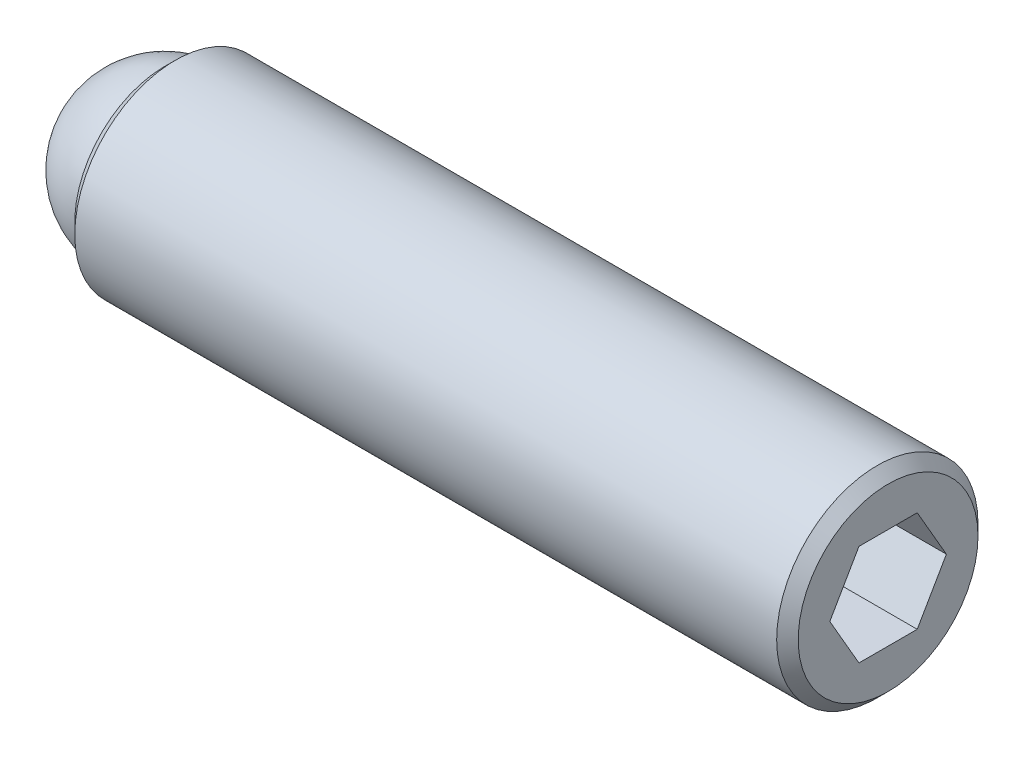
ISO-10303-21;
HEADER;
FILE_DESCRIPTION(('STEP AP214'),'2;1');
FILE_NAME('part.step','',(''),(''),'','','');
FILE_SCHEMA(('AUTOMOTIVE_DESIGN { 1 0 10303 214 1 1 1 1 }'));
ENDSEC;
DATA;
#1=APPLICATION_CONTEXT('core data for automotive mechanical design processes');
#2=APPLICATION_PROTOCOL_DEFINITION('international standard','automotive_design',2000,#1);
#3=PRODUCT_CONTEXT('',#1,'mechanical');
#4=PRODUCT('Part','Part','',(#3));
#5=PRODUCT_RELATED_PRODUCT_CATEGORY('part','',(#4));
#6=PRODUCT_DEFINITION_FORMATION('','',#4);
#7=PRODUCT_DEFINITION_CONTEXT('part definition',#1,'design');
#8=PRODUCT_DEFINITION('design','',#6,#7);
#9=PRODUCT_DEFINITION_SHAPE('','',#8);
#10=(LENGTH_UNIT() NAMED_UNIT(*) SI_UNIT(.MILLI.,.METRE.));
#11=(NAMED_UNIT(*) PLANE_ANGLE_UNIT() SI_UNIT($,.RADIAN.));
#12=(NAMED_UNIT(*) SI_UNIT($,.STERADIAN.) SOLID_ANGLE_UNIT());
#13=UNCERTAINTY_MEASURE_WITH_UNIT(LENGTH_MEASURE(1.E-05),#10,'distance_accuracy_value','');
#14=(GEOMETRIC_REPRESENTATION_CONTEXT(3) GLOBAL_UNCERTAINTY_ASSIGNED_CONTEXT((#13)) GLOBAL_UNIT_ASSIGNED_CONTEXT((#10,
#11,#12)) REPRESENTATION_CONTEXT('',''));
#15=CARTESIAN_POINT('',(0.,0.,0.));
#16=DIRECTION('',(0.,0.,1.));
#17=DIRECTION('',(1.,0.,0.));
#18=AXIS2_PLACEMENT_3D('',#15,#16,#17);
#19=CARTESIAN_POINT('',(0.,0.,0.));
#20=DIRECTION('',(0.,-1.,0.));
#21=DIRECTION('',(0.,0.,1.));
#22=AXIS2_PLACEMENT_3D('',#19,#20,#21);
#23=SPHERICAL_SURFACE('',#22,1.984375);
#24=CARTESIAN_POINT('',(0.,-1.984375,0.));
#25=VERTEX_POINT('',#24);
#26=VERTEX_LOOP('',#25);
#27=FACE_BOUND('',#26,.T.);
#28=ADVANCED_FACE('F42',(#27),#23,.T.);
#29=CLOSED_SHELL('',(#28));
#30=MANIFOLD_SOLID_BREP('B2',#29);
#31=CARTESIAN_POINT('',(17.065625,0.,0.));
#32=DIRECTION('',(-1.,0.,0.));
#33=DIRECTION('',(0.,0.,1.));
#34=AXIS2_PLACEMENT_3D('',#31,#32,#33);
#35=CYLINDRICAL_SURFACE('',#34,2.3749);
#36=CARTESIAN_POINT('',(16.811625,0.,0.));
#37=DIRECTION('',(1.,0.,0.));
#38=DIRECTION('',(0.,0.,-1.));
#39=AXIS2_PLACEMENT_3D('',#36,#37,#38);
#40=CIRCLE('',#39,2.3749);
#41=CARTESIAN_POINT('',(16.811625,0.,-2.3749));
#42=VERTEX_POINT('',#41);
#43=EDGE_CURVE('E40',#42,#42,#40,.F.);
#44=ORIENTED_EDGE('',*,*,#43,.T.);
#45=EDGE_LOOP('',(#44));
#46=FACE_BOUND('',#45,.T.);
#47=CARTESIAN_POINT('',(0.254000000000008,0.,0.));
#48=DIRECTION('',(1.,0.,0.));
#49=DIRECTION('',(0.,0.,-1.));
#50=AXIS2_PLACEMENT_3D('',#47,#48,#49);
#51=CIRCLE('',#50,2.3749);
#52=CARTESIAN_POINT('',(0.254000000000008,0.,-2.3749));
#53=VERTEX_POINT('',#52);
#54=EDGE_CURVE('E158',#53,#53,#51,.T.);
#55=ORIENTED_EDGE('',*,*,#54,.T.);
#56=EDGE_LOOP('',(#55));
#57=FACE_BOUND('',#56,.T.);
#58=ADVANCED_FACE('F55',(#46,#57),#35,.T.);
#59=CARTESIAN_POINT('',(17.065625,0.,0.));
#60=DIRECTION('',(1.,0.,0.));
#61=DIRECTION('',(0.,0.,-1.));
#62=AXIS2_PLACEMENT_3D('',#59,#60,#61);
#63=PLANE('',#62);
#64=DIRECTION('',(0.,0.866025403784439,-0.5));
#65=VECTOR('',#64,1.);
#66=CARTESIAN_POINT('',(17.065625,-1.190625,-0.687407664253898));
#67=LINE('',#66,#65);
#68=CARTESIAN_POINT('',(17.065625,-1.190625,-0.687407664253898));
#69=VERTEX_POINT('',#68);
#70=CARTESIAN_POINT('',(17.065625,0.,-1.3748153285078));
#71=VERTEX_POINT('',#70);
#72=EDGE_CURVE('E70',#69,#71,#67,.T.);
#73=ORIENTED_EDGE('',*,*,#72,.F.);
#74=DIRECTION('',(0.,0.,-1.));
#75=VECTOR('',#74,1.);
#76=CARTESIAN_POINT('',(17.065625,-1.190625,0.687407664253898));
#77=LINE('',#76,#75);
#78=CARTESIAN_POINT('',(17.065625,-1.190625,0.687407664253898));
#79=VERTEX_POINT('',#78);
#80=EDGE_CURVE('E154',#79,#69,#77,.T.);
#81=ORIENTED_EDGE('',*,*,#80,.F.);
#82=DIRECTION('',(0.,-0.866025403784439,-0.5));
#83=VECTOR('',#82,1.);
#84=CARTESIAN_POINT('',(17.065625,0.,1.3748153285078));
#85=LINE('',#84,#83);
#86=CARTESIAN_POINT('',(17.065625,0.,1.3748153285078));
#87=VERTEX_POINT('',#86);
#88=EDGE_CURVE('E152',#87,#79,#85,.T.);
#89=ORIENTED_EDGE('',*,*,#88,.F.);
#90=DIRECTION('',(0.,-0.866025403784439,0.5));
#91=VECTOR('',#90,1.);
#92=CARTESIAN_POINT('',(17.065625,1.190625,0.687407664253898));
#93=LINE('',#92,#91);
#94=CARTESIAN_POINT('',(17.065625,1.190625,0.687407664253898));
#95=VERTEX_POINT('',#94);
#96=EDGE_CURVE('E118',#95,#87,#93,.T.);
#97=ORIENTED_EDGE('',*,*,#96,.F.);
#98=DIRECTION('',(0.,0.,1.));
#99=VECTOR('',#98,1.);
#100=CARTESIAN_POINT('',(17.065625,1.190625,-0.687407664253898));
#101=LINE('',#100,#99);
#102=CARTESIAN_POINT('',(17.065625,1.190625,-0.687407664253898));
#103=VERTEX_POINT('',#102);
#104=EDGE_CURVE('E148',#103,#95,#101,.T.);
#105=ORIENTED_EDGE('',*,*,#104,.F.);
#106=DIRECTION('',(0.,0.866025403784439,0.5));
#107=VECTOR('',#106,1.);
#108=CARTESIAN_POINT('',(17.065625,0.,-1.3748153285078));
#109=LINE('',#108,#107);
#110=EDGE_CURVE('E144',#71,#103,#109,.T.);
#111=ORIENTED_EDGE('',*,*,#110,.F.);
#112=EDGE_LOOP('',(#73,#81,#89,#97,#105,#111));
#113=FACE_BOUND('',#112,.T.);
#114=CARTESIAN_POINT('',(17.065625,0.,0.));
#115=DIRECTION('',(1.,0.,0.));
#116=DIRECTION('',(0.,0.,-1.));
#117=AXIS2_PLACEMENT_3D('',#114,#115,#116);
#118=CIRCLE('',#117,2.1209);
#119=CARTESIAN_POINT('',(17.065625,0.,-2.1209));
#120=VERTEX_POINT('',#119);
#121=EDGE_CURVE('E63',#120,#120,#118,.T.);
#122=ORIENTED_EDGE('',*,*,#121,.T.);
#123=EDGE_LOOP('',(#122));
#124=FACE_BOUND('',#123,.T.);
#125=ADVANCED_FACE('F171',(#113,#124),#63,.T.);
#126=CARTESIAN_POINT('',(0.,0.,0.));
#127=DIRECTION('',(1.,0.,0.));
#128=DIRECTION('',(0.,0.,-1.));
#129=AXIS2_PLACEMENT_3D('',#126,#127,#128);
#130=PLANE('',#129);
#131=CARTESIAN_POINT('',(0.,0.,0.));
#132=DIRECTION('',(-1.,0.,0.));
#133=DIRECTION('',(0.,0.,1.));
#134=AXIS2_PLACEMENT_3D('',#131,#132,#133);
#135=CIRCLE('',#134,1.9812);
#136=CARTESIAN_POINT('',(0.,0.,1.9812));
#137=VERTEX_POINT('',#136);
#138=EDGE_CURVE('E223',#137,#137,#135,.T.);
#139=ORIENTED_EDGE('',*,*,#138,.F.);
#140=EDGE_LOOP('',(#139));
#141=FACE_BOUND('',#140,.T.);
#142=CARTESIAN_POINT('',(0.,0.,0.));
#143=DIRECTION('',(1.,0.,0.));
#144=DIRECTION('',(0.,0.,-1.));
#145=AXIS2_PLACEMENT_3D('',#142,#143,#144);
#146=CIRCLE('',#145,2.12089999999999);
#147=CARTESIAN_POINT('',(0.,0.,-2.12089999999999));
#148=VERTEX_POINT('',#147);
#149=EDGE_CURVE('E166',#148,#148,#146,.F.);
#150=ORIENTED_EDGE('',*,*,#149,.T.);
#151=EDGE_LOOP('',(#150));
#152=FACE_BOUND('',#151,.T.);
#153=ADVANCED_FACE('F182',(#141,#152),#130,.F.);
#154=CARTESIAN_POINT('',(0.254000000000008,0.,0.));
#155=DIRECTION('',(1.,0.,0.));
#156=DIRECTION('',(0.,0.,-1.));
#157=AXIS2_PLACEMENT_3D('',#154,#155,#156);
#158=CONICAL_SURFACE('',#157,2.3749,0.785398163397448);
#159=ORIENTED_EDGE('',*,*,#149,.F.);
#160=EDGE_LOOP('',(#159));
#161=FACE_BOUND('',#160,.T.);
#162=ORIENTED_EDGE('',*,*,#54,.F.);
#163=EDGE_LOOP('',(#162));
#164=FACE_BOUND('',#163,.T.);
#165=ADVANCED_FACE('F175',(#161,#164),#158,.T.);
#166=CARTESIAN_POINT('',(17.065625,0.,0.));
#167=DIRECTION('',(-1.,0.,0.));
#168=DIRECTION('',(0.,0.,1.));
#169=AXIS2_PLACEMENT_3D('',#166,#167,#168);
#170=CONICAL_SURFACE('',#169,2.1209,0.785398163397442);
#171=ORIENTED_EDGE('',*,*,#43,.F.);
#172=EDGE_LOOP('',(#171));
#173=FACE_BOUND('',#172,.T.);
#174=ORIENTED_EDGE('',*,*,#121,.F.);
#175=EDGE_LOOP('',(#174));
#176=FACE_BOUND('',#175,.T.);
#177=ADVANCED_FACE('F57',(#173,#176),#170,.T.);
#178=CARTESIAN_POINT('',(14.779625,-1.190625,-0.687407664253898));
#179=DIRECTION('',(0.,-0.5,-0.866025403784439));
#180=DIRECTION('',(0.,0.866025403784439,-0.5));
#181=AXIS2_PLACEMENT_3D('',#178,#179,#180);
#182=PLANE('',#181);
#183=ORIENTED_EDGE('',*,*,#72,.T.);
#184=DIRECTION('',(1.,0.,0.));
#185=VECTOR('',#184,1.);
#186=CARTESIAN_POINT('',(14.779625,0.,-1.3748153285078));
#187=LINE('',#186,#185);
#188=CARTESIAN_POINT('',(14.779625,0.,-1.3748153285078));
#189=VERTEX_POINT('',#188);
#190=EDGE_CURVE('E100',#189,#71,#187,.T.);
#191=ORIENTED_EDGE('',*,*,#190,.F.);
#192=DIRECTION('',(0.,0.866025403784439,-0.5));
#193=VECTOR('',#192,1.);
#194=CARTESIAN_POINT('',(14.779625,-1.190625,-0.687407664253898));
#195=LINE('',#194,#193);
#196=CARTESIAN_POINT('',(14.779625,-1.190625,-0.687407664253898));
#197=VERTEX_POINT('',#196);
#198=EDGE_CURVE('E156',#197,#189,#195,.T.);
#199=ORIENTED_EDGE('',*,*,#198,.F.);
#200=DIRECTION('',(1.,0.,0.));
#201=VECTOR('',#200,1.);
#202=CARTESIAN_POINT('',(14.779625,-1.190625,-0.687407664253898));
#203=LINE('',#202,#201);
#204=EDGE_CURVE('E78',#197,#69,#203,.T.);
#205=ORIENTED_EDGE('',*,*,#204,.T.);
#206=EDGE_LOOP('',(#183,#191,#199,#205));
#207=FACE_BOUND('',#206,.T.);
#208=ADVANCED_FACE('F174',(#207),#182,.F.);
#209=CARTESIAN_POINT('',(14.779625,-1.190625,0.687407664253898));
#210=DIRECTION('',(0.,-1.,0.));
#211=DIRECTION('',(0.,0.,-1.));
#212=AXIS2_PLACEMENT_3D('',#209,#210,#211);
#213=PLANE('',#212);
#214=ORIENTED_EDGE('',*,*,#80,.T.);
#215=ORIENTED_EDGE('',*,*,#204,.F.);
#216=DIRECTION('',(0.,0.,-1.));
#217=VECTOR('',#216,1.);
#218=CARTESIAN_POINT('',(14.779625,-1.190625,0.687407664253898));
#219=LINE('',#218,#217);
#220=CARTESIAN_POINT('',(14.779625,-1.190625,0.687407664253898));
#221=VERTEX_POINT('',#220);
#222=EDGE_CURVE('E130',#221,#197,#219,.T.);
#223=ORIENTED_EDGE('',*,*,#222,.F.);
#224=DIRECTION('',(1.,0.,0.));
#225=VECTOR('',#224,1.);
#226=CARTESIAN_POINT('',(14.779625,-1.190625,0.687407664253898));
#227=LINE('',#226,#225);
#228=EDGE_CURVE('E122',#221,#79,#227,.T.);
#229=ORIENTED_EDGE('',*,*,#228,.T.);
#230=EDGE_LOOP('',(#214,#215,#223,#229));
#231=FACE_BOUND('',#230,.T.);
#232=ADVANCED_FACE('F180',(#231),#213,.F.);
#233=CARTESIAN_POINT('',(14.779625,0.,1.3748153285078));
#234=DIRECTION('',(0.,-0.5,0.866025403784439));
#235=DIRECTION('',(0.,-0.866025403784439,-0.5));
#236=AXIS2_PLACEMENT_3D('',#233,#234,#235);
#237=PLANE('',#236);
#238=ORIENTED_EDGE('',*,*,#88,.T.);
#239=ORIENTED_EDGE('',*,*,#228,.F.);
#240=DIRECTION('',(0.,-0.866025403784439,-0.5));
#241=VECTOR('',#240,1.);
#242=CARTESIAN_POINT('',(14.779625,0.,1.3748153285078));
#243=LINE('',#242,#241);
#244=CARTESIAN_POINT('',(14.779625,0.,1.3748153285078));
#245=VERTEX_POINT('',#244);
#246=EDGE_CURVE('E126',#245,#221,#243,.T.);
#247=ORIENTED_EDGE('',*,*,#246,.F.);
#248=DIRECTION('',(1.,0.,0.));
#249=VECTOR('',#248,1.);
#250=CARTESIAN_POINT('',(14.779625,0.,1.3748153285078));
#251=LINE('',#250,#249);
#252=EDGE_CURVE('E111',#245,#87,#251,.T.);
#253=ORIENTED_EDGE('',*,*,#252,.T.);
#254=EDGE_LOOP('',(#238,#239,#247,#253));
#255=FACE_BOUND('',#254,.T.);
#256=ADVANCED_FACE('F127',(#255),#237,.F.);
#257=CARTESIAN_POINT('',(14.779625,1.190625,0.687407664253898));
#258=DIRECTION('',(0.,0.5,0.866025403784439));
#259=DIRECTION('',(0.,-0.866025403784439,0.5));
#260=AXIS2_PLACEMENT_3D('',#257,#258,#259);
#261=PLANE('',#260);
#262=ORIENTED_EDGE('',*,*,#96,.T.);
#263=ORIENTED_EDGE('',*,*,#252,.F.);
#264=DIRECTION('',(0.,-0.866025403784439,0.5));
#265=VECTOR('',#264,1.);
#266=CARTESIAN_POINT('',(14.779625,1.190625,0.687407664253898));
#267=LINE('',#266,#265);
#268=CARTESIAN_POINT('',(14.779625,1.190625,0.687407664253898));
#269=VERTEX_POINT('',#268);
#270=EDGE_CURVE('E115',#269,#245,#267,.T.);
#271=ORIENTED_EDGE('',*,*,#270,.F.);
#272=DIRECTION('',(1.,0.,0.));
#273=VECTOR('',#272,1.);
#274=CARTESIAN_POINT('',(14.779625,1.190625,0.687407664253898));
#275=LINE('',#274,#273);
#276=EDGE_CURVE('E123',#269,#95,#275,.T.);
#277=ORIENTED_EDGE('',*,*,#276,.T.);
#278=EDGE_LOOP('',(#262,#263,#271,#277));
#279=FACE_BOUND('',#278,.T.);
#280=ADVANCED_FACE('F113',(#279),#261,.F.);
#281=CARTESIAN_POINT('',(14.779625,1.190625,-0.687407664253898));
#282=DIRECTION('',(0.,1.,0.));
#283=DIRECTION('',(0.,0.,1.));
#284=AXIS2_PLACEMENT_3D('',#281,#282,#283);
#285=PLANE('',#284);
#286=ORIENTED_EDGE('',*,*,#104,.T.);
#287=ORIENTED_EDGE('',*,*,#276,.F.);
#288=DIRECTION('',(0.,0.,1.));
#289=VECTOR('',#288,1.);
#290=CARTESIAN_POINT('',(14.779625,1.190625,-0.687407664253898));
#291=LINE('',#290,#289);
#292=CARTESIAN_POINT('',(14.779625,1.190625,-0.687407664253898));
#293=VERTEX_POINT('',#292);
#294=EDGE_CURVE('E136',#293,#269,#291,.T.);
#295=ORIENTED_EDGE('',*,*,#294,.F.);
#296=DIRECTION('',(1.,0.,0.));
#297=VECTOR('',#296,1.);
#298=CARTESIAN_POINT('',(14.779625,1.190625,-0.687407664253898));
#299=LINE('',#298,#297);
#300=EDGE_CURVE('E161',#293,#103,#299,.T.);
#301=ORIENTED_EDGE('',*,*,#300,.T.);
#302=EDGE_LOOP('',(#286,#287,#295,#301));
#303=FACE_BOUND('',#302,.T.);
#304=ADVANCED_FACE('F200',(#303),#285,.F.);
#305=CARTESIAN_POINT('',(14.779625,0.,-1.3748153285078));
#306=DIRECTION('',(0.,0.5,-0.866025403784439));
#307=DIRECTION('',(0.,0.866025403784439,0.5));
#308=AXIS2_PLACEMENT_3D('',#305,#306,#307);
#309=PLANE('',#308);
#310=ORIENTED_EDGE('',*,*,#110,.T.);
#311=ORIENTED_EDGE('',*,*,#300,.F.);
#312=DIRECTION('',(0.,0.866025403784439,0.5));
#313=VECTOR('',#312,1.);
#314=CARTESIAN_POINT('',(14.779625,0.,-1.3748153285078));
#315=LINE('',#314,#313);
#316=EDGE_CURVE('E138',#189,#293,#315,.T.);
#317=ORIENTED_EDGE('',*,*,#316,.F.);
#318=ORIENTED_EDGE('',*,*,#190,.T.);
#319=EDGE_LOOP('',(#310,#311,#317,#318));
#320=FACE_BOUND('',#319,.T.);
#321=ADVANCED_FACE('F197',(#320),#309,.F.);
#322=CARTESIAN_POINT('',(14.779625,0.,0.));
#323=DIRECTION('',(1.,0.,0.));
#324=DIRECTION('',(0.,0.,-1.));
#325=AXIS2_PLACEMENT_3D('',#322,#323,#324);
#326=PLANE('',#325);
#327=ORIENTED_EDGE('',*,*,#198,.T.);
#328=ORIENTED_EDGE('',*,*,#316,.T.);
#329=ORIENTED_EDGE('',*,*,#294,.T.);
#330=ORIENTED_EDGE('',*,*,#270,.T.);
#331=ORIENTED_EDGE('',*,*,#246,.T.);
#332=ORIENTED_EDGE('',*,*,#222,.T.);
#333=EDGE_LOOP('',(#327,#328,#329,#330,#331,#332));
#334=FACE_BOUND('',#333,.T.);
#335=ADVANCED_FACE('F133',(#334),#326,.T.);
#336=CARTESIAN_POINT('',(1.984375,0.,0.));
#337=DIRECTION('',(-1.,0.,0.));
#338=DIRECTION('',(0.,0.,1.));
#339=AXIS2_PLACEMENT_3D('',#336,#337,#338);
#340=CYLINDRICAL_SURFACE('',#339,1.9812);
#341=CARTESIAN_POINT('',(1.984375,0.,0.));
#342=DIRECTION('',(-1.,0.,0.));
#343=DIRECTION('',(0.,0.,1.));
#344=AXIS2_PLACEMENT_3D('',#341,#342,#343);
#345=CIRCLE('',#344,1.9812);
#346=CARTESIAN_POINT('',(1.984375,0.,1.9812));
#347=VERTEX_POINT('',#346);
#348=EDGE_CURVE('E145',#347,#347,#345,.T.);
#349=ORIENTED_EDGE('',*,*,#348,.F.);
#350=EDGE_LOOP('',(#349));
#351=FACE_BOUND('',#350,.T.);
#352=ORIENTED_EDGE('',*,*,#138,.T.);
#353=EDGE_LOOP('',(#352));
#354=FACE_BOUND('',#353,.T.);
#355=ADVANCED_FACE('F213',(#351,#354),#340,.F.);
#356=CARTESIAN_POINT('',(1.984375,0.,0.));
#357=DIRECTION('',(-1.,0.,0.));
#358=DIRECTION('',(0.,0.,1.));
#359=AXIS2_PLACEMENT_3D('',#356,#357,#358);
#360=PLANE('',#359);
#361=ORIENTED_EDGE('',*,*,#348,.T.);
#362=EDGE_LOOP('',(#361));
#363=FACE_BOUND('',#362,.T.);
#364=ADVANCED_FACE('F216',(#363),#360,.T.);
#365=CLOSED_SHELL('',(#58,#125,#153,#165,#177,#208,#232,#256,#280,#304,#321,#335,#355,#364));
#366=MANIFOLD_SOLID_BREP('B6',#365);
#367=ADVANCED_BREP_SHAPE_REPRESENTATION('',(#18,#30,#366),#14);
#368=SHAPE_DEFINITION_REPRESENTATION(#9,#367);
ENDSEC;
END-ISO-10303-21;
